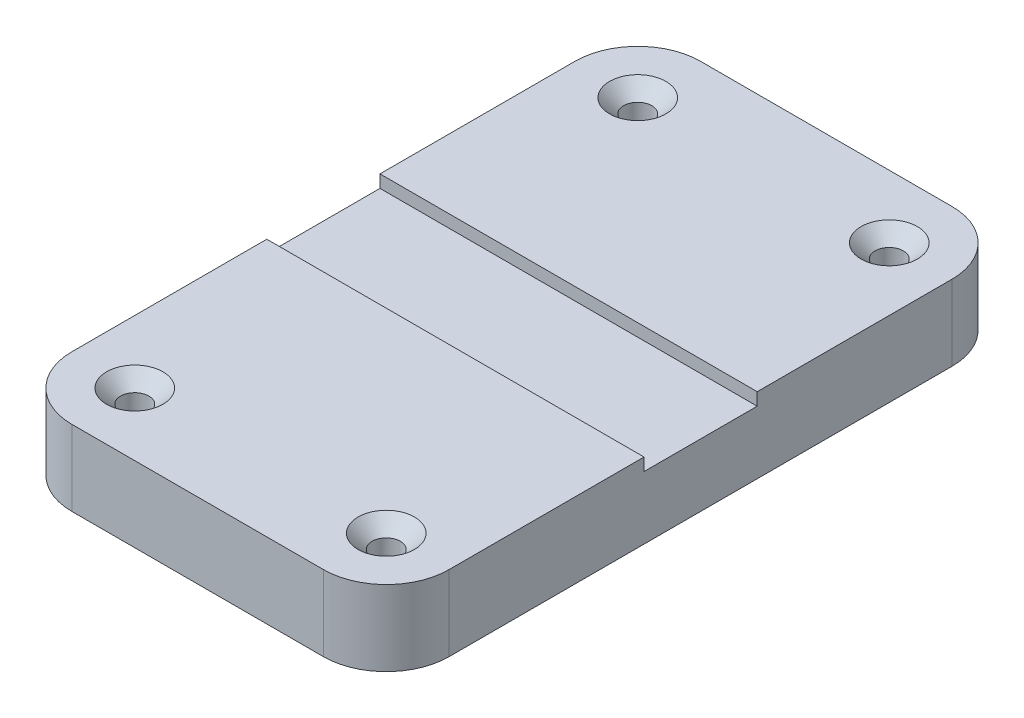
ISO-10303-21;
HEADER;
FILE_DESCRIPTION(('STEP AP214'),'2;1');
FILE_NAME('part.step','',(''),(''),'','','');
FILE_SCHEMA(('AUTOMOTIVE_DESIGN { 1 0 10303 214 1 1 1 1 }'));
ENDSEC;
DATA;
#1=APPLICATION_CONTEXT('core data for automotive mechanical design processes');
#2=APPLICATION_PROTOCOL_DEFINITION('international standard','automotive_design',2000,#1);
#3=PRODUCT_CONTEXT('',#1,'mechanical');
#4=PRODUCT('Part','Part','',(#3));
#5=PRODUCT_RELATED_PRODUCT_CATEGORY('part','',(#4));
#6=PRODUCT_DEFINITION_FORMATION('','',#4);
#7=PRODUCT_DEFINITION_CONTEXT('part definition',#1,'design');
#8=PRODUCT_DEFINITION('design','',#6,#7);
#9=PRODUCT_DEFINITION_SHAPE('','',#8);
#10=(LENGTH_UNIT() NAMED_UNIT(*) SI_UNIT(.MILLI.,.METRE.));
#11=(NAMED_UNIT(*) PLANE_ANGLE_UNIT() SI_UNIT($,.RADIAN.));
#12=(NAMED_UNIT(*) SI_UNIT($,.STERADIAN.) SOLID_ANGLE_UNIT());
#13=UNCERTAINTY_MEASURE_WITH_UNIT(LENGTH_MEASURE(1.E-05),#10,'distance_accuracy_value','');
#14=(GEOMETRIC_REPRESENTATION_CONTEXT(3) GLOBAL_UNCERTAINTY_ASSIGNED_CONTEXT((#13)) GLOBAL_UNIT_ASSIGNED_CONTEXT((#10,
#11,#12)) REPRESENTATION_CONTEXT('',''));
#15=CARTESIAN_POINT('',(0.,0.,0.));
#16=DIRECTION('',(0.,0.,1.));
#17=DIRECTION('',(1.,0.,0.));
#18=AXIS2_PLACEMENT_3D('',#15,#16,#17);
#19=CARTESIAN_POINT('',(0.,12.,0.));
#20=DIRECTION('',(0.,-1.,0.));
#21=DIRECTION('',(0.,0.,-1.));
#22=AXIS2_PLACEMENT_3D('',#19,#20,#21);
#23=PLANE('',#22);
#24=CARTESIAN_POINT('',(10.,12.,-90.));
#25=DIRECTION('',(0.,1.,0.));
#26=DIRECTION('',(0.,0.,1.));
#27=AXIS2_PLACEMENT_3D('',#24,#25,#26);
#28=CIRCLE('',#27,4.48);
#29=CARTESIAN_POINT('',(10.,12.,-85.52));
#30=VERTEX_POINT('',#29);
#31=EDGE_CURVE('E248',#30,#30,#28,.T.);
#32=ORIENTED_EDGE('',*,*,#31,.F.);
#33=EDGE_LOOP('',(#32));
#34=FACE_BOUND('',#33,.T.);
#35=CARTESIAN_POINT('',(50.,12.,-90.));
#36=DIRECTION('',(0.,1.,0.));
#37=DIRECTION('',(0.,0.,1.));
#38=AXIS2_PLACEMENT_3D('',#35,#36,#37);
#39=CIRCLE('',#38,4.48);
#40=CARTESIAN_POINT('',(50.,12.,-85.52));
#41=VERTEX_POINT('',#40);
#42=EDGE_CURVE('E239',#41,#41,#39,.T.);
#43=ORIENTED_EDGE('',*,*,#42,.F.);
#44=EDGE_LOOP('',(#43));
#45=FACE_BOUND('',#44,.T.);
#46=DIRECTION('',(-1.,0.,0.));
#47=VECTOR('',#46,1.);
#48=CARTESIAN_POINT('',(0.,12.,-100.));
#49=LINE('',#48,#47);
#50=CARTESIAN_POINT('',(50.,12.,-100.));
#51=VERTEX_POINT('',#50);
#52=CARTESIAN_POINT('',(9.99999999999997,12.,-100.));
#53=VERTEX_POINT('',#52);
#54=EDGE_CURVE('E163',#51,#53,#49,.T.);
#55=ORIENTED_EDGE('',*,*,#54,.T.);
#56=CARTESIAN_POINT('',(9.99999999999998,12.,-90.));
#57=DIRECTION('',(0.,-1.,0.));
#58=DIRECTION('',(0.,0.,-1.));
#59=AXIS2_PLACEMENT_3D('',#56,#57,#58);
#60=CIRCLE('',#59,10.);
#61=CARTESIAN_POINT('',(0.,12.,-90.));
#62=VERTEX_POINT('',#61);
#63=EDGE_CURVE('E11',#53,#62,#60,.F.);
#64=ORIENTED_EDGE('',*,*,#63,.T.);
#65=DIRECTION('',(0.,0.,1.));
#66=VECTOR('',#65,1.);
#67=CARTESIAN_POINT('',(0.,12.,0.));
#68=LINE('',#67,#66);
#69=CARTESIAN_POINT('',(0.,12.,-59.));
#70=VERTEX_POINT('',#69);
#71=EDGE_CURVE('E155',#62,#70,#68,.T.);
#72=ORIENTED_EDGE('',*,*,#71,.T.);
#73=DIRECTION('',(-1.,0.,0.));
#74=VECTOR('',#73,1.);
#75=CARTESIAN_POINT('',(0.,12.,-59.));
#76=LINE('',#75,#74);
#77=CARTESIAN_POINT('',(60.,12.,-59.));
#78=VERTEX_POINT('',#77);
#79=EDGE_CURVE('E142',#78,#70,#76,.T.);
#80=ORIENTED_EDGE('',*,*,#79,.F.);
#81=DIRECTION('',(0.,0.,-1.));
#82=VECTOR('',#81,1.);
#83=CARTESIAN_POINT('',(60.,12.,0.));
#84=LINE('',#83,#82);
#85=CARTESIAN_POINT('',(60.,12.,-90.));
#86=VERTEX_POINT('',#85);
#87=EDGE_CURVE('E160',#78,#86,#84,.T.);
#88=ORIENTED_EDGE('',*,*,#87,.T.);
#89=CARTESIAN_POINT('',(50.,12.,-90.));
#90=DIRECTION('',(0.,-1.,0.));
#91=DIRECTION('',(0.,0.,-1.));
#92=AXIS2_PLACEMENT_3D('',#89,#90,#91);
#93=CIRCLE('',#92,10.);
#94=EDGE_CURVE('E41',#86,#51,#93,.F.);
#95=ORIENTED_EDGE('',*,*,#94,.T.);
#96=EDGE_LOOP('',(#55,#64,#72,#80,#88,#95));
#97=FACE_BOUND('',#96,.T.);
#98=ADVANCED_FACE('F33',(#34,#45,#97),#23,.F.);
#99=CARTESIAN_POINT('',(0.,12.,0.));
#100=DIRECTION('',(1.,0.,0.));
#101=DIRECTION('',(0.,0.,-1.));
#102=AXIS2_PLACEMENT_3D('',#99,#100,#101);
#103=PLANE('',#102);
#104=DIRECTION('',(0.,0.,1.));
#105=VECTOR('',#104,1.);
#106=CARTESIAN_POINT('',(0.,0.,0.));
#107=LINE('',#106,#105);
#108=CARTESIAN_POINT('',(0.,0.,-90.));
#109=VERTEX_POINT('',#108);
#110=CARTESIAN_POINT('',(0.,0.,-10.));
#111=VERTEX_POINT('',#110);
#112=EDGE_CURVE('E166',#109,#111,#107,.T.);
#113=ORIENTED_EDGE('',*,*,#112,.T.);
#114=DIRECTION('',(0.,-1.,0.));
#115=VECTOR('',#114,1.);
#116=CARTESIAN_POINT('',(0.,12.,-10.));
#117=LINE('',#116,#115);
#118=CARTESIAN_POINT('',(0.,12.,-10.));
#119=VERTEX_POINT('',#118);
#120=EDGE_CURVE('E192',#111,#119,#117,.F.);
#121=ORIENTED_EDGE('',*,*,#120,.T.);
#122=CARTESIAN_POINT('',(0.,12.,-41.));
#123=VERTEX_POINT('',#122);
#124=EDGE_CURVE('E148',#123,#119,#68,.T.);
#125=ORIENTED_EDGE('',*,*,#124,.F.);
#126=DIRECTION('',(0.,1.,0.));
#127=VECTOR('',#126,1.);
#128=CARTESIAN_POINT('',(0.,10.,-41.));
#129=LINE('',#128,#127);
#130=CARTESIAN_POINT('',(0.,10.,-41.));
#131=VERTEX_POINT('',#130);
#132=EDGE_CURVE('E126',#131,#123,#129,.T.);
#133=ORIENTED_EDGE('',*,*,#132,.F.);
#134=DIRECTION('',(0.,0.,1.));
#135=VECTOR('',#134,1.);
#136=CARTESIAN_POINT('',(0.,10.,-59.));
#137=LINE('',#136,#135);
#138=CARTESIAN_POINT('',(0.,10.,-59.));
#139=VERTEX_POINT('',#138);
#140=EDGE_CURVE('E133',#139,#131,#137,.T.);
#141=ORIENTED_EDGE('',*,*,#140,.F.);
#142=DIRECTION('',(0.,1.,0.));
#143=VECTOR('',#142,1.);
#144=CARTESIAN_POINT('',(0.,10.,-59.));
#145=LINE('',#144,#143);
#146=EDGE_CURVE('E169',#139,#70,#145,.T.);
#147=ORIENTED_EDGE('',*,*,#146,.T.);
#148=ORIENTED_EDGE('',*,*,#71,.F.);
#149=DIRECTION('',(0.,-1.,0.));
#150=VECTOR('',#149,1.);
#151=CARTESIAN_POINT('',(0.,12.,-90.));
#152=LINE('',#151,#150);
#153=EDGE_CURVE('E189',#62,#109,#152,.T.);
#154=ORIENTED_EDGE('',*,*,#153,.T.);
#155=EDGE_LOOP('',(#113,#121,#125,#133,#141,#147,#148,#154));
#156=FACE_BOUND('',#155,.T.);
#157=ADVANCED_FACE('F146',(#156),#103,.F.);
#158=CARTESIAN_POINT('',(0.,12.,0.));
#159=DIRECTION('',(0.,0.,-1.));
#160=DIRECTION('',(-1.,0.,0.));
#161=AXIS2_PLACEMENT_3D('',#158,#159,#160);
#162=PLANE('',#161);
#163=DIRECTION('',(1.,0.,0.));
#164=VECTOR('',#163,1.);
#165=CARTESIAN_POINT('',(0.,12.,0.));
#166=LINE('',#165,#164);
#167=CARTESIAN_POINT('',(9.99999999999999,12.,0.));
#168=VERTEX_POINT('',#167);
#169=CARTESIAN_POINT('',(50.,12.,0.));
#170=VERTEX_POINT('',#169);
#171=EDGE_CURVE('E157',#168,#170,#166,.T.);
#172=ORIENTED_EDGE('',*,*,#171,.F.);
#173=DIRECTION('',(0.,-1.,0.));
#174=VECTOR('',#173,1.);
#175=CARTESIAN_POINT('',(10.,12.,0.));
#176=LINE('',#175,#174);
#177=CARTESIAN_POINT('',(9.99999999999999,0.,0.));
#178=VERTEX_POINT('',#177);
#179=EDGE_CURVE('E178',#168,#178,#176,.T.);
#180=ORIENTED_EDGE('',*,*,#179,.T.);
#181=DIRECTION('',(1.,0.,0.));
#182=VECTOR('',#181,1.);
#183=CARTESIAN_POINT('',(0.,0.,0.));
#184=LINE('',#183,#182);
#185=CARTESIAN_POINT('',(50.,0.,0.));
#186=VERTEX_POINT('',#185);
#187=EDGE_CURVE('E168',#178,#186,#184,.T.);
#188=ORIENTED_EDGE('',*,*,#187,.T.);
#189=DIRECTION('',(0.,-1.,0.));
#190=VECTOR('',#189,1.);
#191=CARTESIAN_POINT('',(50.,12.,0.));
#192=LINE('',#191,#190);
#193=EDGE_CURVE('E165',#186,#170,#192,.F.);
#194=ORIENTED_EDGE('',*,*,#193,.T.);
#195=EDGE_LOOP('',(#172,#180,#188,#194));
#196=FACE_BOUND('',#195,.T.);
#197=ADVANCED_FACE('F284',(#196),#162,.F.);
#198=CARTESIAN_POINT('',(60.,12.,0.));
#199=DIRECTION('',(-1.,0.,0.));
#200=DIRECTION('',(0.,0.,1.));
#201=AXIS2_PLACEMENT_3D('',#198,#199,#200);
#202=PLANE('',#201);
#203=CARTESIAN_POINT('',(60.,12.,-10.));
#204=VERTEX_POINT('',#203);
#205=CARTESIAN_POINT('',(60.,12.,-41.));
#206=VERTEX_POINT('',#205);
#207=EDGE_CURVE('E161',#204,#206,#84,.T.);
#208=ORIENTED_EDGE('',*,*,#207,.F.);
#209=DIRECTION('',(0.,-1.,0.));
#210=VECTOR('',#209,1.);
#211=CARTESIAN_POINT('',(60.,12.,-10.));
#212=LINE('',#211,#210);
#213=CARTESIAN_POINT('',(60.,0.,-10.));
#214=VERTEX_POINT('',#213);
#215=EDGE_CURVE('E200',#204,#214,#212,.T.);
#216=ORIENTED_EDGE('',*,*,#215,.T.);
#217=DIRECTION('',(0.,0.,-1.));
#218=VECTOR('',#217,1.);
#219=CARTESIAN_POINT('',(60.,0.,0.));
#220=LINE('',#219,#218);
#221=CARTESIAN_POINT('',(60.,0.,-90.));
#222=VERTEX_POINT('',#221);
#223=EDGE_CURVE('E172',#214,#222,#220,.T.);
#224=ORIENTED_EDGE('',*,*,#223,.T.);
#225=DIRECTION('',(0.,-1.,0.));
#226=VECTOR('',#225,1.);
#227=CARTESIAN_POINT('',(60.,12.,-90.));
#228=LINE('',#227,#226);
#229=EDGE_CURVE('E198',#222,#86,#228,.F.);
#230=ORIENTED_EDGE('',*,*,#229,.T.);
#231=ORIENTED_EDGE('',*,*,#87,.F.);
#232=DIRECTION('',(0.,1.,0.));
#233=VECTOR('',#232,1.);
#234=CARTESIAN_POINT('',(60.,10.,-59.));
#235=LINE('',#234,#233);
#236=CARTESIAN_POINT('',(60.,10.,-59.));
#237=VERTEX_POINT('',#236);
#238=EDGE_CURVE('E150',#237,#78,#235,.T.);
#239=ORIENTED_EDGE('',*,*,#238,.F.);
#240=DIRECTION('',(0.,0.,-1.));
#241=VECTOR('',#240,1.);
#242=CARTESIAN_POINT('',(60.,10.,-59.));
#243=LINE('',#242,#241);
#244=CARTESIAN_POINT('',(60.,10.,-41.));
#245=VERTEX_POINT('',#244);
#246=EDGE_CURVE('E132',#245,#237,#243,.T.);
#247=ORIENTED_EDGE('',*,*,#246,.F.);
#248=DIRECTION('',(0.,1.,0.));
#249=VECTOR('',#248,1.);
#250=CARTESIAN_POINT('',(60.,10.,-41.));
#251=LINE('',#250,#249);
#252=EDGE_CURVE('E129',#245,#206,#251,.T.);
#253=ORIENTED_EDGE('',*,*,#252,.T.);
#254=EDGE_LOOP('',(#208,#216,#224,#230,#231,#239,#247,#253));
#255=FACE_BOUND('',#254,.T.);
#256=ADVANCED_FACE('F292',(#255),#202,.F.);
#257=CARTESIAN_POINT('',(0.,12.,-100.));
#258=DIRECTION('',(0.,0.,1.));
#259=DIRECTION('',(1.,0.,0.));
#260=AXIS2_PLACEMENT_3D('',#257,#258,#259);
#261=PLANE('',#260);
#262=DIRECTION('',(-1.,0.,0.));
#263=VECTOR('',#262,1.);
#264=CARTESIAN_POINT('',(0.,0.,-100.));
#265=LINE('',#264,#263);
#266=CARTESIAN_POINT('',(50.,0.,-100.));
#267=VERTEX_POINT('',#266);
#268=CARTESIAN_POINT('',(9.99999999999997,0.,-100.));
#269=VERTEX_POINT('',#268);
#270=EDGE_CURVE('E175',#267,#269,#265,.T.);
#271=ORIENTED_EDGE('',*,*,#270,.T.);
#272=DIRECTION('',(0.,-1.,0.));
#273=VECTOR('',#272,1.);
#274=CARTESIAN_POINT('',(9.99999999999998,12.,-100.));
#275=LINE('',#274,#273);
#276=EDGE_CURVE('E48',#269,#53,#275,.F.);
#277=ORIENTED_EDGE('',*,*,#276,.T.);
#278=ORIENTED_EDGE('',*,*,#54,.F.);
#279=DIRECTION('',(0.,-1.,0.));
#280=VECTOR('',#279,1.);
#281=CARTESIAN_POINT('',(50.,12.,-100.));
#282=LINE('',#281,#280);
#283=EDGE_CURVE('E203',#51,#267,#282,.T.);
#284=ORIENTED_EDGE('',*,*,#283,.T.);
#285=EDGE_LOOP('',(#271,#277,#278,#284));
#286=FACE_BOUND('',#285,.T.);
#287=ADVANCED_FACE('F208',(#286),#261,.F.);
#288=CARTESIAN_POINT('',(10.,12.,-10.));
#289=DIRECTION('',(0.,1.,0.));
#290=DIRECTION('',(0.,0.,1.));
#291=AXIS2_PLACEMENT_3D('',#288,#289,#290);
#292=CIRCLE('',#291,4.48);
#293=CARTESIAN_POINT('',(10.,12.,-5.52));
#294=VERTEX_POINT('',#293);
#295=EDGE_CURVE('E266',#294,#294,#292,.T.);
#296=ORIENTED_EDGE('',*,*,#295,.F.);
#297=EDGE_LOOP('',(#296));
#298=FACE_BOUND('',#297,.T.);
#299=CARTESIAN_POINT('',(50.,12.,-10.));
#300=DIRECTION('',(0.,1.,0.));
#301=DIRECTION('',(0.,0.,1.));
#302=AXIS2_PLACEMENT_3D('',#299,#300,#301);
#303=CIRCLE('',#302,4.48);
#304=CARTESIAN_POINT('',(50.,12.,-5.52));
#305=VERTEX_POINT('',#304);
#306=EDGE_CURVE('E257',#305,#305,#303,.T.);
#307=ORIENTED_EDGE('',*,*,#306,.F.);
#308=EDGE_LOOP('',(#307));
#309=FACE_BOUND('',#308,.T.);
#310=ORIENTED_EDGE('',*,*,#124,.T.);
#311=CARTESIAN_POINT('',(10.,12.,-10.));
#312=DIRECTION('',(0.,-1.,0.));
#313=DIRECTION('',(0.,0.,-1.));
#314=AXIS2_PLACEMENT_3D('',#311,#312,#313);
#315=CIRCLE('',#314,10.);
#316=EDGE_CURVE('E196',#119,#168,#315,.F.);
#317=ORIENTED_EDGE('',*,*,#316,.T.);
#318=ORIENTED_EDGE('',*,*,#171,.T.);
#319=CARTESIAN_POINT('',(50.,12.,-10.));
#320=DIRECTION('',(0.,-1.,0.));
#321=DIRECTION('',(0.,0.,-1.));
#322=AXIS2_PLACEMENT_3D('',#319,#320,#321);
#323=CIRCLE('',#322,10.);
#324=EDGE_CURVE('E194',#170,#204,#323,.F.);
#325=ORIENTED_EDGE('',*,*,#324,.T.);
#326=ORIENTED_EDGE('',*,*,#207,.T.);
#327=DIRECTION('',(1.,0.,0.));
#328=VECTOR('',#327,1.);
#329=CARTESIAN_POINT('',(0.,12.,-41.));
#330=LINE('',#329,#328);
#331=EDGE_CURVE('E227',#123,#206,#330,.T.);
#332=ORIENTED_EDGE('',*,*,#331,.F.);
#333=EDGE_LOOP('',(#310,#317,#318,#325,#326,#332));
#334=FACE_BOUND('',#333,.T.);
#335=ADVANCED_FACE('F272',(#298,#309,#334),#23,.F.);
#336=CARTESIAN_POINT('',(0.,0.,0.));
#337=DIRECTION('',(0.,-1.,0.));
#338=DIRECTION('',(0.,0.,-1.));
#339=AXIS2_PLACEMENT_3D('',#336,#337,#338);
#340=PLANE('',#339);
#341=CARTESIAN_POINT('',(10.,0.,-10.));
#342=DIRECTION('',(0.,1.,0.));
#343=DIRECTION('',(0.,0.,1.));
#344=AXIS2_PLACEMENT_3D('',#341,#342,#343);
#345=CIRCLE('',#344,2.25);
#346=CARTESIAN_POINT('',(10.,0.,-7.75));
#347=VERTEX_POINT('',#346);
#348=EDGE_CURVE('E260',#347,#347,#345,.T.);
#349=ORIENTED_EDGE('',*,*,#348,.T.);
#350=EDGE_LOOP('',(#349));
#351=FACE_BOUND('',#350,.T.);
#352=CARTESIAN_POINT('',(50.,0.,-10.));
#353=DIRECTION('',(0.,1.,0.));
#354=DIRECTION('',(0.,0.,1.));
#355=AXIS2_PLACEMENT_3D('',#352,#353,#354);
#356=CIRCLE('',#355,2.25);
#357=CARTESIAN_POINT('',(50.,0.,-7.75000000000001));
#358=VERTEX_POINT('',#357);
#359=EDGE_CURVE('E251',#358,#358,#356,.T.);
#360=ORIENTED_EDGE('',*,*,#359,.T.);
#361=EDGE_LOOP('',(#360));
#362=FACE_BOUND('',#361,.T.);
#363=CARTESIAN_POINT('',(10.,0.,-90.));
#364=DIRECTION('',(0.,1.,0.));
#365=DIRECTION('',(0.,0.,1.));
#366=AXIS2_PLACEMENT_3D('',#363,#364,#365);
#367=CIRCLE('',#366,2.25);
#368=CARTESIAN_POINT('',(10.,0.,-87.75));
#369=VERTEX_POINT('',#368);
#370=EDGE_CURVE('E242',#369,#369,#367,.T.);
#371=ORIENTED_EDGE('',*,*,#370,.T.);
#372=EDGE_LOOP('',(#371));
#373=FACE_BOUND('',#372,.T.);
#374=CARTESIAN_POINT('',(50.,0.,-90.));
#375=DIRECTION('',(0.,1.,0.));
#376=DIRECTION('',(0.,0.,1.));
#377=AXIS2_PLACEMENT_3D('',#374,#375,#376);
#378=CIRCLE('',#377,2.25);
#379=CARTESIAN_POINT('',(50.,0.,-87.75));
#380=VERTEX_POINT('',#379);
#381=EDGE_CURVE('E229',#380,#380,#378,.T.);
#382=ORIENTED_EDGE('',*,*,#381,.T.);
#383=EDGE_LOOP('',(#382));
#384=FACE_BOUND('',#383,.T.);
#385=ORIENTED_EDGE('',*,*,#187,.F.);
#386=CARTESIAN_POINT('',(10.,0.,-10.));
#387=DIRECTION('',(0.,-1.,0.));
#388=DIRECTION('',(0.,0.,-1.));
#389=AXIS2_PLACEMENT_3D('',#386,#387,#388);
#390=CIRCLE('',#389,10.);
#391=EDGE_CURVE('E187',#178,#111,#390,.T.);
#392=ORIENTED_EDGE('',*,*,#391,.T.);
#393=ORIENTED_EDGE('',*,*,#112,.F.);
#394=CARTESIAN_POINT('',(9.99999999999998,0.,-90.));
#395=DIRECTION('',(0.,-1.,0.));
#396=DIRECTION('',(0.,0.,-1.));
#397=AXIS2_PLACEMENT_3D('',#394,#395,#396);
#398=CIRCLE('',#397,10.);
#399=EDGE_CURVE('E183',#109,#269,#398,.T.);
#400=ORIENTED_EDGE('',*,*,#399,.T.);
#401=ORIENTED_EDGE('',*,*,#270,.F.);
#402=CARTESIAN_POINT('',(50.,0.,-90.));
#403=DIRECTION('',(0.,-1.,0.));
#404=DIRECTION('',(0.,0.,-1.));
#405=AXIS2_PLACEMENT_3D('',#402,#403,#404);
#406=CIRCLE('',#405,10.);
#407=EDGE_CURVE('E181',#267,#222,#406,.T.);
#408=ORIENTED_EDGE('',*,*,#407,.T.);
#409=ORIENTED_EDGE('',*,*,#223,.F.);
#410=CARTESIAN_POINT('',(50.,0.,-10.));
#411=DIRECTION('',(0.,-1.,0.));
#412=DIRECTION('',(0.,0.,-1.));
#413=AXIS2_PLACEMENT_3D('',#410,#411,#412);
#414=CIRCLE('',#413,10.);
#415=EDGE_CURVE('E185',#214,#186,#414,.T.);
#416=ORIENTED_EDGE('',*,*,#415,.T.);
#417=EDGE_LOOP('',(#385,#392,#393,#400,#401,#408,#409,#416));
#418=FACE_BOUND('',#417,.T.);
#419=ADVANCED_FACE('F212',(#351,#362,#373,#384,#418),#340,.T.);
#420=CARTESIAN_POINT('',(0.,10.,-59.));
#421=DIRECTION('',(0.,0.,-1.));
#422=DIRECTION('',(-1.,0.,0.));
#423=AXIS2_PLACEMENT_3D('',#420,#421,#422);
#424=PLANE('',#423);
#425=ORIENTED_EDGE('',*,*,#79,.T.);
#426=ORIENTED_EDGE('',*,*,#146,.F.);
#427=DIRECTION('',(-1.,0.,0.));
#428=VECTOR('',#427,1.);
#429=CARTESIAN_POINT('',(0.,10.,-59.));
#430=LINE('',#429,#428);
#431=EDGE_CURVE('E139',#237,#139,#430,.T.);
#432=ORIENTED_EDGE('',*,*,#431,.F.);
#433=ORIENTED_EDGE('',*,*,#238,.T.);
#434=EDGE_LOOP('',(#425,#426,#432,#433));
#435=FACE_BOUND('',#434,.T.);
#436=ADVANCED_FACE('F225',(#435),#424,.F.);
#437=CARTESIAN_POINT('',(0.,10.,-41.));
#438=DIRECTION('',(0.,0.,1.));
#439=DIRECTION('',(1.,0.,0.));
#440=AXIS2_PLACEMENT_3D('',#437,#438,#439);
#441=PLANE('',#440);
#442=ORIENTED_EDGE('',*,*,#331,.T.);
#443=ORIENTED_EDGE('',*,*,#252,.F.);
#444=DIRECTION('',(1.,0.,0.));
#445=VECTOR('',#444,1.);
#446=CARTESIAN_POINT('',(0.,10.,-41.));
#447=LINE('',#446,#445);
#448=EDGE_CURVE('E121',#131,#245,#447,.T.);
#449=ORIENTED_EDGE('',*,*,#448,.F.);
#450=ORIENTED_EDGE('',*,*,#132,.T.);
#451=EDGE_LOOP('',(#442,#443,#449,#450));
#452=FACE_BOUND('',#451,.T.);
#453=ADVANCED_FACE('F124',(#452),#441,.F.);
#454=CARTESIAN_POINT('',(0.,10.,0.));
#455=DIRECTION('',(0.,1.,0.));
#456=DIRECTION('',(0.,0.,1.));
#457=AXIS2_PLACEMENT_3D('',#454,#455,#456);
#458=PLANE('',#457);
#459=ORIENTED_EDGE('',*,*,#140,.T.);
#460=ORIENTED_EDGE('',*,*,#448,.T.);
#461=ORIENTED_EDGE('',*,*,#246,.T.);
#462=ORIENTED_EDGE('',*,*,#431,.T.);
#463=EDGE_LOOP('',(#459,#460,#461,#462));
#464=FACE_BOUND('',#463,.T.);
#465=ADVANCED_FACE('F137',(#464),#458,.T.);
#466=CARTESIAN_POINT('',(10.,12.,-10.));
#467=DIRECTION('',(0.,-1.,0.));
#468=DIRECTION('',(0.,0.,-1.));
#469=AXIS2_PLACEMENT_3D('',#466,#467,#468);
#470=CYLINDRICAL_SURFACE('',#469,10.);
#471=ORIENTED_EDGE('',*,*,#316,.F.);
#472=ORIENTED_EDGE('',*,*,#120,.F.);
#473=ORIENTED_EDGE('',*,*,#391,.F.);
#474=ORIENTED_EDGE('',*,*,#179,.F.);
#475=EDGE_LOOP('',(#471,#472,#473,#474));
#476=FACE_BOUND('',#475,.T.);
#477=ADVANCED_FACE('F282',(#476),#470,.T.);
#478=CARTESIAN_POINT('',(50.,12.,-10.));
#479=DIRECTION('',(0.,-1.,0.));
#480=DIRECTION('',(0.,0.,-1.));
#481=AXIS2_PLACEMENT_3D('',#478,#479,#480);
#482=CYLINDRICAL_SURFACE('',#481,10.);
#483=ORIENTED_EDGE('',*,*,#324,.F.);
#484=ORIENTED_EDGE('',*,*,#193,.F.);
#485=ORIENTED_EDGE('',*,*,#415,.F.);
#486=ORIENTED_EDGE('',*,*,#215,.F.);
#487=EDGE_LOOP('',(#483,#484,#485,#486));
#488=FACE_BOUND('',#487,.T.);
#489=ADVANCED_FACE('F289',(#488),#482,.T.);
#490=CARTESIAN_POINT('',(9.99999999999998,12.,-90.));
#491=DIRECTION('',(0.,-1.,0.));
#492=DIRECTION('',(0.,0.,-1.));
#493=AXIS2_PLACEMENT_3D('',#490,#491,#492);
#494=CYLINDRICAL_SURFACE('',#493,10.);
#495=ORIENTED_EDGE('',*,*,#63,.F.);
#496=ORIENTED_EDGE('',*,*,#276,.F.);
#497=ORIENTED_EDGE('',*,*,#399,.F.);
#498=ORIENTED_EDGE('',*,*,#153,.F.);
#499=EDGE_LOOP('',(#495,#496,#497,#498));
#500=FACE_BOUND('',#499,.T.);
#501=ADVANCED_FACE('F218',(#500),#494,.T.);
#502=CARTESIAN_POINT('',(50.,12.,-90.));
#503=DIRECTION('',(0.,-1.,0.));
#504=DIRECTION('',(0.,0.,-1.));
#505=AXIS2_PLACEMENT_3D('',#502,#503,#504);
#506=CYLINDRICAL_SURFACE('',#505,10.);
#507=ORIENTED_EDGE('',*,*,#94,.F.);
#508=ORIENTED_EDGE('',*,*,#229,.F.);
#509=ORIENTED_EDGE('',*,*,#407,.F.);
#510=ORIENTED_EDGE('',*,*,#283,.F.);
#511=EDGE_LOOP('',(#507,#508,#509,#510));
#512=FACE_BOUND('',#511,.T.);
#513=ADVANCED_FACE('F35',(#512),#506,.T.);
#514=CARTESIAN_POINT('',(50.,12.,-90.));
#515=DIRECTION('',(0.,1.,0.));
#516=DIRECTION('',(0.,0.,1.));
#517=AXIS2_PLACEMENT_3D('',#514,#515,#516);
#518=CYLINDRICAL_SURFACE('',#517,2.25);
#519=ORIENTED_EDGE('',*,*,#381,.F.);
#520=EDGE_LOOP('',(#519));
#521=FACE_BOUND('',#520,.T.);
#522=CARTESIAN_POINT('',(50.,9.77,-90.));
#523=DIRECTION('',(0.,1.,0.));
#524=DIRECTION('',(0.,0.,1.));
#525=AXIS2_PLACEMENT_3D('',#522,#523,#524);
#526=CIRCLE('',#525,2.25);
#527=CARTESIAN_POINT('',(50.,9.77,-87.75));
#528=VERTEX_POINT('',#527);
#529=EDGE_CURVE('E236',#528,#528,#526,.T.);
#530=ORIENTED_EDGE('',*,*,#529,.T.);
#531=EDGE_LOOP('',(#530));
#532=FACE_BOUND('',#531,.T.);
#533=ADVANCED_FACE('F295',(#521,#532),#518,.F.);
#534=CARTESIAN_POINT('',(50.,12.,-90.));
#535=DIRECTION('',(0.,1.,0.));
#536=DIRECTION('',(0.,0.,1.));
#537=AXIS2_PLACEMENT_3D('',#534,#535,#536);
#538=CONICAL_SURFACE('',#537,4.48,0.785398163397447);
#539=ORIENTED_EDGE('',*,*,#529,.F.);
#540=EDGE_LOOP('',(#539));
#541=FACE_BOUND('',#540,.T.);
#542=ORIENTED_EDGE('',*,*,#42,.T.);
#543=EDGE_LOOP('',(#542));
#544=FACE_BOUND('',#543,.T.);
#545=ADVANCED_FACE('F300',(#541,#544),#538,.F.);
#546=CARTESIAN_POINT('',(10.,12.,-90.));
#547=DIRECTION('',(0.,1.,0.));
#548=DIRECTION('',(0.,0.,1.));
#549=AXIS2_PLACEMENT_3D('',#546,#547,#548);
#550=CYLINDRICAL_SURFACE('',#549,2.25);
#551=ORIENTED_EDGE('',*,*,#370,.F.);
#552=EDGE_LOOP('',(#551));
#553=FACE_BOUND('',#552,.T.);
#554=CARTESIAN_POINT('',(10.,9.77,-90.));
#555=DIRECTION('',(0.,1.,0.));
#556=DIRECTION('',(0.,0.,1.));
#557=AXIS2_PLACEMENT_3D('',#554,#555,#556);
#558=CIRCLE('',#557,2.25);
#559=CARTESIAN_POINT('',(10.,9.77,-87.75));
#560=VERTEX_POINT('',#559);
#561=EDGE_CURVE('E245',#560,#560,#558,.T.);
#562=ORIENTED_EDGE('',*,*,#561,.T.);
#563=EDGE_LOOP('',(#562));
#564=FACE_BOUND('',#563,.T.);
#565=ADVANCED_FACE('F373',(#553,#564),#550,.F.);
#566=CARTESIAN_POINT('',(10.,12.,-90.));
#567=DIRECTION('',(0.,1.,0.));
#568=DIRECTION('',(0.,0.,1.));
#569=AXIS2_PLACEMENT_3D('',#566,#567,#568);
#570=CONICAL_SURFACE('',#569,4.48,0.785398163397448);
#571=ORIENTED_EDGE('',*,*,#561,.F.);
#572=EDGE_LOOP('',(#571));
#573=FACE_BOUND('',#572,.T.);
#574=ORIENTED_EDGE('',*,*,#31,.T.);
#575=EDGE_LOOP('',(#574));
#576=FACE_BOUND('',#575,.T.);
#577=ADVANCED_FACE('F383',(#573,#576),#570,.F.);
#578=CARTESIAN_POINT('',(50.,12.,-10.));
#579=DIRECTION('',(0.,1.,0.));
#580=DIRECTION('',(0.,0.,1.));
#581=AXIS2_PLACEMENT_3D('',#578,#579,#580);
#582=CYLINDRICAL_SURFACE('',#581,2.25);
#583=ORIENTED_EDGE('',*,*,#359,.F.);
#584=EDGE_LOOP('',(#583));
#585=FACE_BOUND('',#584,.T.);
#586=CARTESIAN_POINT('',(50.,9.77,-10.));
#587=DIRECTION('',(0.,1.,0.));
#588=DIRECTION('',(0.,0.,1.));
#589=AXIS2_PLACEMENT_3D('',#586,#587,#588);
#590=CIRCLE('',#589,2.25);
#591=CARTESIAN_POINT('',(50.,9.77,-7.75));
#592=VERTEX_POINT('',#591);
#593=EDGE_CURVE('E254',#592,#592,#590,.T.);
#594=ORIENTED_EDGE('',*,*,#593,.T.);
#595=EDGE_LOOP('',(#594));
#596=FACE_BOUND('',#595,.T.);
#597=ADVANCED_FACE('F393',(#585,#596),#582,.F.);
#598=CARTESIAN_POINT('',(50.,12.,-10.));
#599=DIRECTION('',(0.,1.,0.));
#600=DIRECTION('',(0.,0.,1.));
#601=AXIS2_PLACEMENT_3D('',#598,#599,#600);
#602=CONICAL_SURFACE('',#601,4.48,0.785398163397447);
#603=ORIENTED_EDGE('',*,*,#593,.F.);
#604=EDGE_LOOP('',(#603));
#605=FACE_BOUND('',#604,.T.);
#606=ORIENTED_EDGE('',*,*,#306,.T.);
#607=EDGE_LOOP('',(#606));
#608=FACE_BOUND('',#607,.T.);
#609=ADVANCED_FACE('F403',(#605,#608),#602,.F.);
#610=CARTESIAN_POINT('',(10.,12.,-10.));
#611=DIRECTION('',(0.,1.,0.));
#612=DIRECTION('',(0.,0.,1.));
#613=AXIS2_PLACEMENT_3D('',#610,#611,#612);
#614=CYLINDRICAL_SURFACE('',#613,2.25);
#615=ORIENTED_EDGE('',*,*,#348,.F.);
#616=EDGE_LOOP('',(#615));
#617=FACE_BOUND('',#616,.T.);
#618=CARTESIAN_POINT('',(10.,9.77,-10.));
#619=DIRECTION('',(0.,1.,0.));
#620=DIRECTION('',(0.,0.,1.));
#621=AXIS2_PLACEMENT_3D('',#618,#619,#620);
#622=CIRCLE('',#621,2.25);
#623=CARTESIAN_POINT('',(10.,9.77,-7.75));
#624=VERTEX_POINT('',#623);
#625=EDGE_CURVE('E263',#624,#624,#622,.T.);
#626=ORIENTED_EDGE('',*,*,#625,.T.);
#627=EDGE_LOOP('',(#626));
#628=FACE_BOUND('',#627,.T.);
#629=ADVANCED_FACE('F413',(#617,#628),#614,.F.);
#630=CARTESIAN_POINT('',(10.,12.,-10.));
#631=DIRECTION('',(0.,1.,0.));
#632=DIRECTION('',(0.,0.,1.));
#633=AXIS2_PLACEMENT_3D('',#630,#631,#632);
#634=CONICAL_SURFACE('',#633,4.48,0.785398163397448);
#635=ORIENTED_EDGE('',*,*,#625,.F.);
#636=EDGE_LOOP('',(#635));
#637=FACE_BOUND('',#636,.T.);
#638=ORIENTED_EDGE('',*,*,#295,.T.);
#639=EDGE_LOOP('',(#638));
#640=FACE_BOUND('',#639,.T.);
#641=ADVANCED_FACE('F270',(#637,#640),#634,.F.);
#642=CLOSED_SHELL('',(#98,#157,#197,#256,#287,#335,#419,#436,#453,#465,#477,#489,#501,#513,#533,
#545,#565,#577,#597,#609,#629,#641));
#643=MANIFOLD_SOLID_BREP('B2',#642);
#644=ADVANCED_BREP_SHAPE_REPRESENTATION('',(#18,#643),#14);
#645=SHAPE_DEFINITION_REPRESENTATION(#9,#644);
ENDSEC;
END-ISO-10303-21;
